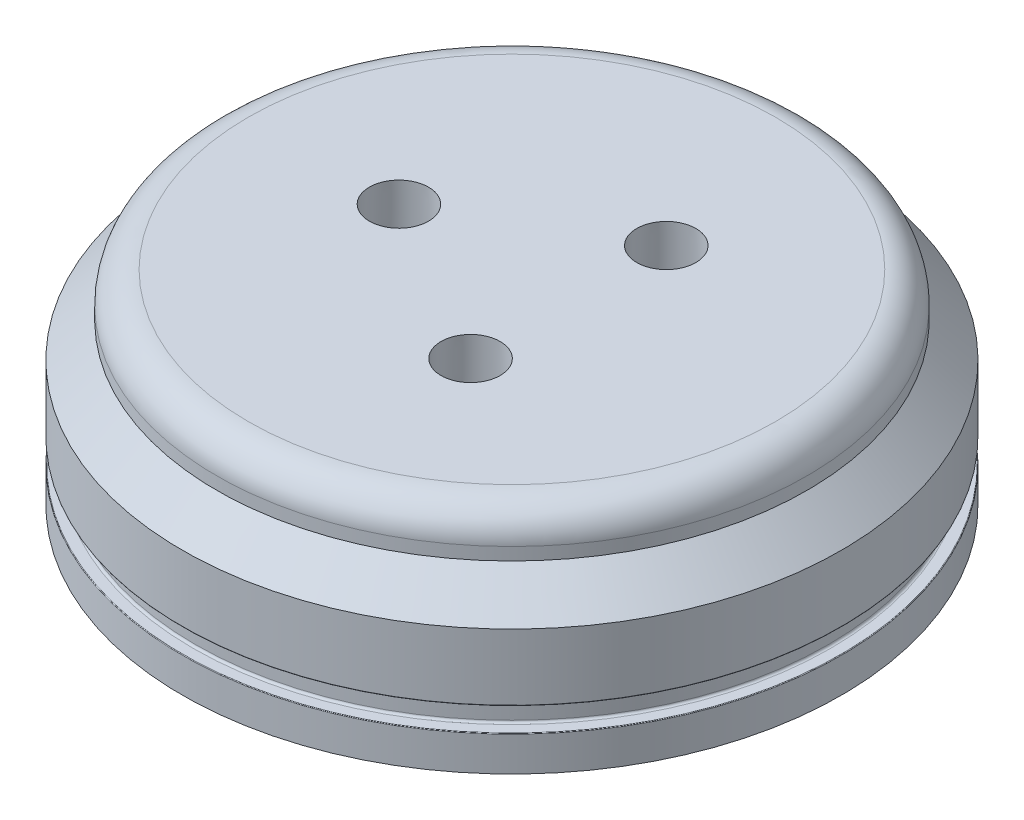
ISO-10303-21;
HEADER;
FILE_DESCRIPTION(('STEP AP214'),'2;1');
FILE_NAME('part.step','',(''),(''),'','','');
FILE_SCHEMA(('AUTOMOTIVE_DESIGN { 1 0 10303 214 1 1 1 1 }'));
ENDSEC;
DATA;
#1=APPLICATION_CONTEXT('core data for automotive mechanical design processes');
#2=APPLICATION_PROTOCOL_DEFINITION('international standard','automotive_design',2000,#1);
#3=PRODUCT_CONTEXT('',#1,'mechanical');
#4=PRODUCT('Part','Part','',(#3));
#5=PRODUCT_RELATED_PRODUCT_CATEGORY('part','',(#4));
#6=PRODUCT_DEFINITION_FORMATION('','',#4);
#7=PRODUCT_DEFINITION_CONTEXT('part definition',#1,'design');
#8=PRODUCT_DEFINITION('design','',#6,#7);
#9=PRODUCT_DEFINITION_SHAPE('','',#8);
#10=(LENGTH_UNIT() NAMED_UNIT(*) SI_UNIT(.MILLI.,.METRE.));
#11=(NAMED_UNIT(*) PLANE_ANGLE_UNIT() SI_UNIT($,.RADIAN.));
#12=(NAMED_UNIT(*) SI_UNIT($,.STERADIAN.) SOLID_ANGLE_UNIT());
#13=UNCERTAINTY_MEASURE_WITH_UNIT(LENGTH_MEASURE(1.E-05),#10,'distance_accuracy_value','');
#14=(GEOMETRIC_REPRESENTATION_CONTEXT(3) GLOBAL_UNCERTAINTY_ASSIGNED_CONTEXT((#13)) GLOBAL_UNIT_ASSIGNED_CONTEXT((#10,
#11,#12)) REPRESENTATION_CONTEXT('',''));
#15=CARTESIAN_POINT('',(0.,0.,0.));
#16=DIRECTION('',(0.,0.,1.));
#17=DIRECTION('',(1.,0.,0.));
#18=AXIS2_PLACEMENT_3D('',#15,#16,#17);
#19=CARTESIAN_POINT('',(-50.8,0.,0.));
#20=DIRECTION('',(0.,1.,0.));
#21=DIRECTION('',(0.,0.,1.));
#22=AXIS2_PLACEMENT_3D('',#19,#20,#21);
#23=PLANE('',#22);
#24=CARTESIAN_POINT('',(30.0705983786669,0.,-50.4564467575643));
#25=DIRECTION('',(0.,-1.,0.));
#26=DIRECTION('',(0.,0.,-1.));
#27=AXIS2_PLACEMENT_3D('',#24,#25,#26);
#28=CIRCLE('',#27,1.72719999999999);
#29=CARTESIAN_POINT('',(30.0705983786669,0.,-52.1836467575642));
#30=VERTEX_POINT('',#29);
#31=EDGE_CURVE('E89',#30,#30,#28,.T.);
#32=ORIENTED_EDGE('',*,*,#31,.F.);
#33=EDGE_LOOP('',(#32));
#34=FACE_BOUND('',#33,.T.);
#35=CARTESIAN_POINT('',(-38.6946065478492,0.,-44.1907380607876));
#36=DIRECTION('',(0.,-1.,0.));
#37=DIRECTION('',(0.,0.,-1.));
#38=AXIS2_PLACEMENT_3D('',#35,#36,#37);
#39=CIRCLE('',#38,1.72719999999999);
#40=CARTESIAN_POINT('',(-38.6946065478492,0.,-45.9179380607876));
#41=VERTEX_POINT('',#40);
#42=EDGE_CURVE('E106',#41,#41,#39,.T.);
#43=ORIENTED_EDGE('',*,*,#42,.F.);
#44=EDGE_LOOP('',(#43));
#45=FACE_BOUND('',#44,.T.);
#46=CARTESIAN_POINT('',(-57.6983010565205,0.,10.9999982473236));
#47=DIRECTION('',(0.,-1.,0.));
#48=DIRECTION('',(0.,0.,-1.));
#49=AXIS2_PLACEMENT_3D('',#46,#47,#48);
#50=CIRCLE('',#49,1.72719999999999);
#51=CARTESIAN_POINT('',(-57.6983010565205,0.,9.27279824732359));
#52=VERTEX_POINT('',#51);
#53=EDGE_CURVE('E112',#52,#52,#50,.T.);
#54=ORIENTED_EDGE('',*,*,#53,.F.);
#55=EDGE_LOOP('',(#54));
#56=FACE_BOUND('',#55,.T.);
#57=CARTESIAN_POINT('',(0.,0.,0.));
#58=DIRECTION('',(0.,-1.,0.));
#59=DIRECTION('',(0.,0.,-1.));
#60=AXIS2_PLACEMENT_3D('',#57,#58,#59);
#61=CIRCLE('',#60,66.675);
#62=CARTESIAN_POINT('',(0.,0.,-66.675));
#63=VERTEX_POINT('',#62);
#64=EDGE_CURVE('E175',#63,#63,#61,.T.);
#65=ORIENTED_EDGE('',*,*,#64,.T.);
#66=EDGE_LOOP('',(#65));
#67=FACE_BOUND('',#66,.T.);
#68=CARTESIAN_POINT('',(0.,0.,0.));
#69=DIRECTION('',(0.,-1.,0.));
#70=DIRECTION('',(0.,0.,-1.));
#71=AXIS2_PLACEMENT_3D('',#68,#69,#70);
#72=CIRCLE('',#71,50.8);
#73=CARTESIAN_POINT('',(0.,0.,-50.8));
#74=VERTEX_POINT('',#73);
#75=EDGE_CURVE('E178',#74,#74,#72,.T.);
#76=ORIENTED_EDGE('',*,*,#75,.F.);
#77=EDGE_LOOP('',(#76));
#78=FACE_BOUND('',#77,.T.);
#79=CARTESIAN_POINT('',(57.2792584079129,0.,13.0069390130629));
#80=DIRECTION('',(0.,-1.,0.));
#81=DIRECTION('',(0.,0.,-1.));
#82=AXIS2_PLACEMENT_3D('',#79,#80,#81);
#83=CIRCLE('',#82,1.72719999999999);
#84=CARTESIAN_POINT('',(57.2792584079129,0.,11.2797390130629));
#85=VERTEX_POINT('',#84);
#86=EDGE_CURVE('E142',#85,#85,#83,.T.);
#87=ORIENTED_EDGE('',*,*,#86,.F.);
#88=EDGE_LOOP('',(#87));
#89=FACE_BOUND('',#88,.T.);
#90=CARTESIAN_POINT('',(53.1445428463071,0.,25.0150249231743));
#91=DIRECTION('',(0.,-1.,0.));
#92=DIRECTION('',(0.,0.,-1.));
#93=AXIS2_PLACEMENT_3D('',#90,#91,#92);
#94=CIRCLE('',#93,1.72719999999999);
#95=CARTESIAN_POINT('',(53.1445428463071,0.,23.2878249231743));
#96=VERTEX_POINT('',#95);
#97=EDGE_CURVE('E136',#96,#96,#94,.T.);
#98=ORIENTED_EDGE('',*,*,#97,.F.);
#99=EDGE_LOOP('',(#98));
#100=FACE_BOUND('',#99,.T.);
#101=CARTESIAN_POINT('',(5.32993016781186,0.,58.4951771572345));
#102=DIRECTION('',(0.,-1.,0.));
#103=DIRECTION('',(0.,0.,-1.));
#104=AXIS2_PLACEMENT_3D('',#101,#102,#103);
#105=CIRCLE('',#104,1.72719999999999);
#106=CARTESIAN_POINT('',(5.32993016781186,0.,56.7679771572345));
#107=VERTEX_POINT('',#106);
#108=EDGE_CURVE('E130',#107,#107,#105,.T.);
#109=ORIENTED_EDGE('',*,*,#108,.F.);
#110=EDGE_LOOP('',(#109));
#111=FACE_BOUND('',#110,.T.);
#112=CARTESIAN_POINT('',(-7.36813556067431,0.,58.273531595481));
#113=DIRECTION('',(0.,-1.,0.));
#114=DIRECTION('',(0.,0.,-1.));
#115=AXIS2_PLACEMENT_3D('',#112,#113,#114);
#116=CIRCLE('',#115,1.72719999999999);
#117=CARTESIAN_POINT('',(-7.36813556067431,0.,56.546331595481));
#118=VERTEX_POINT('',#117);
#119=EDGE_CURVE('E124',#118,#118,#116,.T.);
#120=ORIENTED_EDGE('',*,*,#119,.F.);
#121=EDGE_LOOP('',(#120));
#122=FACE_BOUND('',#121,.T.);
#123=CARTESIAN_POINT('',(-53.9851804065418,0.,23.1450686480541));
#124=DIRECTION('',(0.,-1.,0.));
#125=DIRECTION('',(0.,0.,-1.));
#126=AXIS2_PLACEMENT_3D('',#123,#124,#125);
#127=CIRCLE('',#126,1.72719999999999);
#128=CARTESIAN_POINT('',(-53.9851804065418,0.,21.4178686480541));
#129=VERTEX_POINT('',#128);
#130=EDGE_CURVE('E118',#129,#129,#127,.T.);
#131=ORIENTED_EDGE('',*,*,#130,.F.);
#132=EDGE_LOOP('',(#131));
#133=FACE_BOUND('',#132,.T.);
#134=CARTESIAN_POINT('',(-28.291375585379,0.,-51.4751588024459));
#135=DIRECTION('',(0.,-1.,0.));
#136=DIRECTION('',(0.,0.,-1.));
#137=AXIS2_PLACEMENT_3D('',#134,#135,#136);
#138=CIRCLE('',#137,1.72719999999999);
#139=CARTESIAN_POINT('',(-28.291375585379,0.,-53.2023588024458));
#140=VERTEX_POINT('',#139);
#141=EDGE_CURVE('E100',#140,#140,#138,.T.);
#142=ORIENTED_EDGE('',*,*,#141,.F.);
#143=EDGE_LOOP('',(#142));
#144=FACE_BOUND('',#143,.T.);
#145=CARTESIAN_POINT('',(40.2132693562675,0.,-42.8133959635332));
#146=DIRECTION('',(0.,-1.,0.));
#147=DIRECTION('',(0.,0.,-1.));
#148=AXIS2_PLACEMENT_3D('',#145,#146,#147);
#149=CIRCLE('',#148,1.72719999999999);
#150=CARTESIAN_POINT('',(40.2132693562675,0.,-44.5405959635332));
#151=VERTEX_POINT('',#150);
#152=EDGE_CURVE('E90',#151,#151,#149,.T.);
#153=ORIENTED_EDGE('',*,*,#152,.F.);
#154=EDGE_LOOP('',(#153));
#155=FACE_BOUND('',#154,.T.);
#156=ADVANCED_FACE('F40',(#34,#45,#56,#67,#78,#89,#100,#111,#122,#133,#144,#155),#23,.F.);
#157=CARTESIAN_POINT('',(-59.69,41.275,0.));
#158=DIRECTION('',(0.,-1.,0.));
#159=DIRECTION('',(0.,0.,-1.));
#160=AXIS2_PLACEMENT_3D('',#157,#158,#159);
#161=PLANE('',#160);
#162=CARTESIAN_POINT('',(0.,41.275,0.));
#163=DIRECTION('',(0.,-1.,0.));
#164=DIRECTION('',(0.,0.,-1.));
#165=AXIS2_PLACEMENT_3D('',#162,#163,#164);
#166=CIRCLE('',#165,53.34);
#167=CARTESIAN_POINT('',(0.,41.275,-53.34));
#168=VERTEX_POINT('',#167);
#169=EDGE_CURVE('E205',#168,#168,#166,.F.);
#170=ORIENTED_EDGE('',*,*,#169,.T.);
#171=EDGE_LOOP('',(#170));
#172=FACE_BOUND('',#171,.T.);
#173=CARTESIAN_POINT('',(11.4299999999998,41.275,19.7973407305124));
#174=DIRECTION('',(0.,-1.,0.));
#175=DIRECTION('',(0.,0.,-1.));
#176=AXIS2_PLACEMENT_3D('',#173,#174,#175);
#177=CIRCLE('',#176,5.97790349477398);
#178=CARTESIAN_POINT('',(11.4299999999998,41.275,13.8194372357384));
#179=VERTEX_POINT('',#178);
#180=EDGE_CURVE('E151',#179,#179,#177,.T.);
#181=ORIENTED_EDGE('',*,*,#180,.T.);
#182=EDGE_LOOP('',(#181));
#183=FACE_BOUND('',#182,.T.);
#184=CARTESIAN_POINT('',(-22.86,41.275,0.));
#185=DIRECTION('',(0.,-1.,0.));
#186=DIRECTION('',(0.,0.,-1.));
#187=AXIS2_PLACEMENT_3D('',#184,#185,#186);
#188=CIRCLE('',#187,5.97790349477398);
#189=CARTESIAN_POINT('',(-22.86,41.275,-5.97790349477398));
#190=VERTEX_POINT('',#189);
#191=EDGE_CURVE('E163',#190,#190,#188,.T.);
#192=ORIENTED_EDGE('',*,*,#191,.T.);
#193=EDGE_LOOP('',(#192));
#194=FACE_BOUND('',#193,.T.);
#195=CARTESIAN_POINT('',(11.4300000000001,41.275,-19.7973407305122));
#196=DIRECTION('',(0.,-1.,0.));
#197=DIRECTION('',(0.,0.,-1.));
#198=AXIS2_PLACEMENT_3D('',#195,#196,#197);
#199=CIRCLE('',#198,5.97790349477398);
#200=CARTESIAN_POINT('',(11.4300000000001,41.275,-25.7752442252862));
#201=VERTEX_POINT('',#200);
#202=EDGE_CURVE('E157',#201,#201,#199,.T.);
#203=ORIENTED_EDGE('',*,*,#202,.T.);
#204=EDGE_LOOP('',(#203));
#205=FACE_BOUND('',#204,.T.);
#206=ADVANCED_FACE('F227',(#172,#183,#194,#205),#161,.F.);
#207=CARTESIAN_POINT('',(0.,7.5565,0.));
#208=DIRECTION('',(0.,-1.,0.));
#209=DIRECTION('',(0.,0.,-1.));
#210=AXIS2_PLACEMENT_3D('',#207,#208,#209);
#211=TOROIDAL_SURFACE('',#210,64.4779,0.444500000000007);
#212=CARTESIAN_POINT('',(0.,7.112,0.));
#213=DIRECTION('',(0.,-1.,0.));
#214=DIRECTION('',(0.,0.,-1.));
#215=AXIS2_PLACEMENT_3D('',#212,#213,#214);
#216=CIRCLE('',#215,64.4779);
#217=CARTESIAN_POINT('',(0.,7.112,-64.4779));
#218=VERTEX_POINT('',#217);
#219=EDGE_CURVE('E166',#218,#218,#216,.T.);
#220=ORIENTED_EDGE('',*,*,#219,.F.);
#221=EDGE_LOOP('',(#220));
#222=FACE_BOUND('',#221,.T.);
#223=CARTESIAN_POINT('',(0.,7.5565,0.));
#224=DIRECTION('',(0.,-1.,0.));
#225=DIRECTION('',(0.,0.,-1.));
#226=AXIS2_PLACEMENT_3D('',#223,#224,#225);
#227=CIRCLE('',#226,64.0334);
#228=CARTESIAN_POINT('',(0.,7.5565,-64.0334));
#229=VERTEX_POINT('',#228);
#230=EDGE_CURVE('E199',#229,#229,#227,.T.);
#231=ORIENTED_EDGE('',*,*,#230,.T.);
#232=EDGE_LOOP('',(#231));
#233=FACE_BOUND('',#232,.T.);
#234=ADVANCED_FACE('F233',(#222,#233),#211,.F.);
#235=CARTESIAN_POINT('',(0.,0.,0.));
#236=DIRECTION('',(0.,-1.,0.));
#237=DIRECTION('',(0.,0.,-1.));
#238=AXIS2_PLACEMENT_3D('',#235,#236,#237);
#239=CYLINDRICAL_SURFACE('',#238,64.0334);
#240=ORIENTED_EDGE('',*,*,#230,.F.);
#241=EDGE_LOOP('',(#240));
#242=FACE_BOUND('',#241,.T.);
#243=CARTESIAN_POINT('',(0.,11.4935,0.));
#244=DIRECTION('',(0.,-1.,0.));
#245=DIRECTION('',(0.,0.,-1.));
#246=AXIS2_PLACEMENT_3D('',#243,#244,#245);
#247=CIRCLE('',#246,64.0334);
#248=CARTESIAN_POINT('',(0.,11.4935,-64.0334));
#249=VERTEX_POINT('',#248);
#250=EDGE_CURVE('E196',#249,#249,#247,.T.);
#251=ORIENTED_EDGE('',*,*,#250,.T.);
#252=EDGE_LOOP('',(#251));
#253=FACE_BOUND('',#252,.T.);
#254=ADVANCED_FACE('F271',(#242,#253),#239,.T.);
#255=CARTESIAN_POINT('',(0.,11.4935,0.));
#256=DIRECTION('',(0.,-1.,0.));
#257=DIRECTION('',(0.,0.,-1.));
#258=AXIS2_PLACEMENT_3D('',#255,#256,#257);
#259=TOROIDAL_SURFACE('',#258,64.4779,0.444500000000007);
#260=ORIENTED_EDGE('',*,*,#250,.F.);
#261=EDGE_LOOP('',(#260));
#262=FACE_BOUND('',#261,.T.);
#263=CARTESIAN_POINT('',(0.,11.938,0.));
#264=DIRECTION('',(0.,-1.,0.));
#265=DIRECTION('',(0.,0.,-1.));
#266=AXIS2_PLACEMENT_3D('',#263,#264,#265);
#267=CIRCLE('',#266,64.4779);
#268=CARTESIAN_POINT('',(0.,11.938,-64.4779));
#269=VERTEX_POINT('',#268);
#270=EDGE_CURVE('E193',#269,#269,#267,.T.);
#271=ORIENTED_EDGE('',*,*,#270,.T.);
#272=EDGE_LOOP('',(#271));
#273=FACE_BOUND('',#272,.T.);
#274=ADVANCED_FACE('F267',(#262,#273),#259,.F.);
#275=CARTESIAN_POINT('',(-66.548,11.938,0.));
#276=DIRECTION('',(0.,1.,0.));
#277=DIRECTION('',(0.,0.,1.));
#278=AXIS2_PLACEMENT_3D('',#275,#276,#277);
#279=PLANE('',#278);
#280=ORIENTED_EDGE('',*,*,#270,.F.);
#281=EDGE_LOOP('',(#280));
#282=FACE_BOUND('',#281,.T.);
#283=CARTESIAN_POINT('',(0.,11.938,0.));
#284=DIRECTION('',(0.,-1.,0.));
#285=DIRECTION('',(0.,0.,-1.));
#286=AXIS2_PLACEMENT_3D('',#283,#284,#285);
#287=CIRCLE('',#286,66.548);
#288=CARTESIAN_POINT('',(0.,11.938,-66.548));
#289=VERTEX_POINT('',#288);
#290=EDGE_CURVE('E190',#289,#289,#287,.T.);
#291=ORIENTED_EDGE('',*,*,#290,.T.);
#292=EDGE_LOOP('',(#291));
#293=FACE_BOUND('',#292,.T.);
#294=ADVANCED_FACE('F263',(#282,#293),#279,.F.);
#295=CARTESIAN_POINT('',(0.,12.065,0.));
#296=DIRECTION('',(0.,-1.,0.));
#297=DIRECTION('',(0.,0.,-1.));
#298=AXIS2_PLACEMENT_3D('',#295,#296,#297);
#299=TOROIDAL_SURFACE('',#298,66.548,0.127000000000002);
#300=ORIENTED_EDGE('',*,*,#290,.F.);
#301=EDGE_LOOP('',(#300));
#302=FACE_BOUND('',#301,.T.);
#303=CARTESIAN_POINT('',(0.,12.065,0.));
#304=DIRECTION('',(0.,-1.,0.));
#305=DIRECTION('',(0.,0.,-1.));
#306=AXIS2_PLACEMENT_3D('',#303,#304,#305);
#307=CIRCLE('',#306,66.675);
#308=CARTESIAN_POINT('',(0.,12.065,-66.675));
#309=VERTEX_POINT('',#308);
#310=EDGE_CURVE('E187',#309,#309,#307,.T.);
#311=ORIENTED_EDGE('',*,*,#310,.T.);
#312=EDGE_LOOP('',(#311));
#313=FACE_BOUND('',#312,.T.);
#314=ADVANCED_FACE('F259',(#302,#313),#299,.T.);
#315=CARTESIAN_POINT('',(0.,0.,0.));
#316=DIRECTION('',(0.,-1.,0.));
#317=DIRECTION('',(0.,0.,-1.));
#318=AXIS2_PLACEMENT_3D('',#315,#316,#317);
#319=CYLINDRICAL_SURFACE('',#318,66.675);
#320=ORIENTED_EDGE('',*,*,#310,.F.);
#321=EDGE_LOOP('',(#320));
#322=FACE_BOUND('',#321,.T.);
#323=CARTESIAN_POINT('',(0.,25.4,0.));
#324=DIRECTION('',(0.,-1.,0.));
#325=DIRECTION('',(0.,0.,-1.));
#326=AXIS2_PLACEMENT_3D('',#323,#324,#325);
#327=CIRCLE('',#326,66.675);
#328=CARTESIAN_POINT('',(0.,25.4,-66.675));
#329=VERTEX_POINT('',#328);
#330=EDGE_CURVE('E184',#329,#329,#327,.T.);
#331=ORIENTED_EDGE('',*,*,#330,.T.);
#332=EDGE_LOOP('',(#331));
#333=FACE_BOUND('',#332,.T.);
#334=ADVANCED_FACE('F255',(#322,#333),#319,.T.);
#335=CARTESIAN_POINT('',(0.,32.385,0.));
#336=DIRECTION('',(0.,-1.,0.));
#337=DIRECTION('',(0.,0.,-1.));
#338=AXIS2_PLACEMENT_3D('',#335,#336,#337);
#339=CONICAL_SURFACE('',#338,59.69,0.78539816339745);
#340=ORIENTED_EDGE('',*,*,#330,.F.);
#341=EDGE_LOOP('',(#340));
#342=FACE_BOUND('',#341,.T.);
#343=CARTESIAN_POINT('',(0.,32.385,0.));
#344=DIRECTION('',(0.,-1.,0.));
#345=DIRECTION('',(0.,0.,-1.));
#346=AXIS2_PLACEMENT_3D('',#343,#344,#345);
#347=CIRCLE('',#346,59.69);
#348=CARTESIAN_POINT('',(0.,32.385,-59.69));
#349=VERTEX_POINT('',#348);
#350=EDGE_CURVE('E181',#349,#349,#347,.T.);
#351=ORIENTED_EDGE('',*,*,#350,.T.);
#352=EDGE_LOOP('',(#351));
#353=FACE_BOUND('',#352,.T.);
#354=ADVANCED_FACE('F251',(#342,#353),#339,.T.);
#355=CARTESIAN_POINT('',(0.,0.,0.));
#356=DIRECTION('',(0.,-1.,0.));
#357=DIRECTION('',(0.,0.,-1.));
#358=AXIS2_PLACEMENT_3D('',#355,#356,#357);
#359=CYLINDRICAL_SURFACE('',#358,59.69);
#360=CARTESIAN_POINT('',(0.,34.925,0.));
#361=DIRECTION('',(0.,-1.,0.));
#362=DIRECTION('',(0.,0.,-1.));
#363=AXIS2_PLACEMENT_3D('',#360,#361,#362);
#364=CIRCLE('',#363,59.69);
#365=CARTESIAN_POINT('',(0.,34.925,-59.69));
#366=VERTEX_POINT('',#365);
#367=EDGE_CURVE('E202',#366,#366,#364,.T.);
#368=ORIENTED_EDGE('',*,*,#367,.T.);
#369=EDGE_LOOP('',(#368));
#370=FACE_BOUND('',#369,.T.);
#371=ORIENTED_EDGE('',*,*,#350,.F.);
#372=EDGE_LOOP('',(#371));
#373=FACE_BOUND('',#372,.T.);
#374=ADVANCED_FACE('F247',(#370,#373),#359,.T.);
#375=CARTESIAN_POINT('',(-50.8,32.385,0.));
#376=DIRECTION('',(0.,1.,0.));
#377=DIRECTION('',(0.,0.,1.));
#378=AXIS2_PLACEMENT_3D('',#375,#376,#377);
#379=PLANE('',#378);
#380=CARTESIAN_POINT('',(0.,32.385,0.));
#381=DIRECTION('',(0.,1.,0.));
#382=DIRECTION('',(0.,0.,1.));
#383=AXIS2_PLACEMENT_3D('',#380,#381,#382);
#384=CIRCLE('',#383,44.45);
#385=CARTESIAN_POINT('',(0.,32.385,44.45));
#386=VERTEX_POINT('',#385);
#387=EDGE_CURVE('E48',#386,#386,#384,.F.);
#388=ORIENTED_EDGE('',*,*,#387,.T.);
#389=EDGE_LOOP('',(#388));
#390=FACE_BOUND('',#389,.T.);
#391=CARTESIAN_POINT('',(11.4299999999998,32.385,19.7973407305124));
#392=DIRECTION('',(0.,-1.,0.));
#393=DIRECTION('',(0.,0.,-1.));
#394=AXIS2_PLACEMENT_3D('',#391,#392,#393);
#395=CIRCLE('',#394,6.244082);
#396=CARTESIAN_POINT('',(11.4299999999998,32.385,13.5532587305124));
#397=VERTEX_POINT('',#396);
#398=EDGE_CURVE('E148',#397,#397,#395,.T.);
#399=ORIENTED_EDGE('',*,*,#398,.F.);
#400=EDGE_LOOP('',(#399));
#401=FACE_BOUND('',#400,.T.);
#402=CARTESIAN_POINT('',(11.4300000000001,32.385,-19.7973407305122));
#403=DIRECTION('',(0.,-1.,0.));
#404=DIRECTION('',(0.,0.,-1.));
#405=AXIS2_PLACEMENT_3D('',#402,#403,#404);
#406=CIRCLE('',#405,6.244082);
#407=CARTESIAN_POINT('',(11.4300000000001,32.385,-26.0414227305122));
#408=VERTEX_POINT('',#407);
#409=EDGE_CURVE('E154',#408,#408,#406,.T.);
#410=ORIENTED_EDGE('',*,*,#409,.F.);
#411=EDGE_LOOP('',(#410));
#412=FACE_BOUND('',#411,.T.);
#413=CARTESIAN_POINT('',(-22.86,32.385,0.));
#414=DIRECTION('',(0.,-1.,0.));
#415=DIRECTION('',(0.,0.,-1.));
#416=AXIS2_PLACEMENT_3D('',#413,#414,#415);
#417=CIRCLE('',#416,6.244082);
#418=CARTESIAN_POINT('',(-22.86,32.385,-6.244082));
#419=VERTEX_POINT('',#418);
#420=EDGE_CURVE('E160',#419,#419,#417,.T.);
#421=ORIENTED_EDGE('',*,*,#420,.F.);
#422=EDGE_LOOP('',(#421));
#423=FACE_BOUND('',#422,.T.);
#424=ADVANCED_FACE('F210',(#390,#401,#412,#423),#379,.F.);
#425=CARTESIAN_POINT('',(0.,0.,0.));
#426=DIRECTION('',(0.,-1.,0.));
#427=DIRECTION('',(0.,0.,-1.));
#428=AXIS2_PLACEMENT_3D('',#425,#426,#427);
#429=CYLINDRICAL_SURFACE('',#428,50.8);
#430=CARTESIAN_POINT('',(0.,26.035,0.));
#431=DIRECTION('',(0.,1.,0.));
#432=DIRECTION('',(0.,0.,1.));
#433=AXIS2_PLACEMENT_3D('',#430,#431,#432);
#434=CIRCLE('',#433,50.8);
#435=CARTESIAN_POINT('',(0.,26.035,50.8));
#436=VERTEX_POINT('',#435);
#437=EDGE_CURVE('E11',#436,#436,#434,.T.);
#438=ORIENTED_EDGE('',*,*,#437,.T.);
#439=EDGE_LOOP('',(#438));
#440=FACE_BOUND('',#439,.T.);
#441=ORIENTED_EDGE('',*,*,#75,.T.);
#442=EDGE_LOOP('',(#441));
#443=FACE_BOUND('',#442,.T.);
#444=ADVANCED_FACE('F242',(#440,#443),#429,.F.);
#445=CARTESIAN_POINT('',(0.,0.,0.));
#446=DIRECTION('',(0.,-1.,0.));
#447=DIRECTION('',(0.,0.,-1.));
#448=AXIS2_PLACEMENT_3D('',#445,#446,#447);
#449=CYLINDRICAL_SURFACE('',#448,66.675);
#450=ORIENTED_EDGE('',*,*,#64,.F.);
#451=EDGE_LOOP('',(#450));
#452=FACE_BOUND('',#451,.T.);
#453=CARTESIAN_POINT('',(0.,6.985,0.));
#454=DIRECTION('',(0.,-1.,0.));
#455=DIRECTION('',(0.,0.,-1.));
#456=AXIS2_PLACEMENT_3D('',#453,#454,#455);
#457=CIRCLE('',#456,66.675);
#458=CARTESIAN_POINT('',(0.,6.985,-66.675));
#459=VERTEX_POINT('',#458);
#460=EDGE_CURVE('E172',#459,#459,#457,.T.);
#461=ORIENTED_EDGE('',*,*,#460,.T.);
#462=EDGE_LOOP('',(#461));
#463=FACE_BOUND('',#462,.T.);
#464=ADVANCED_FACE('F240',(#452,#463),#449,.T.);
#465=CARTESIAN_POINT('',(0.,6.985,0.));
#466=DIRECTION('',(0.,-1.,0.));
#467=DIRECTION('',(0.,0.,-1.));
#468=AXIS2_PLACEMENT_3D('',#465,#466,#467);
#469=TOROIDAL_SURFACE('',#468,66.548,0.127000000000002);
#470=ORIENTED_EDGE('',*,*,#460,.F.);
#471=EDGE_LOOP('',(#470));
#472=FACE_BOUND('',#471,.T.);
#473=CARTESIAN_POINT('',(0.,7.112,0.));
#474=DIRECTION('',(0.,-1.,0.));
#475=DIRECTION('',(0.,0.,-1.));
#476=AXIS2_PLACEMENT_3D('',#473,#474,#475);
#477=CIRCLE('',#476,66.548);
#478=CARTESIAN_POINT('',(0.,7.112,-66.548));
#479=VERTEX_POINT('',#478);
#480=EDGE_CURVE('E169',#479,#479,#477,.T.);
#481=ORIENTED_EDGE('',*,*,#480,.T.);
#482=EDGE_LOOP('',(#481));
#483=FACE_BOUND('',#482,.T.);
#484=ADVANCED_FACE('F300',(#472,#483),#469,.T.);
#485=CARTESIAN_POINT('',(-64.4779,7.112,0.));
#486=DIRECTION('',(0.,-1.,0.));
#487=DIRECTION('',(0.,0.,-1.));
#488=AXIS2_PLACEMENT_3D('',#485,#486,#487);
#489=PLANE('',#488);
#490=ORIENTED_EDGE('',*,*,#480,.F.);
#491=EDGE_LOOP('',(#490));
#492=FACE_BOUND('',#491,.T.);
#493=ORIENTED_EDGE('',*,*,#219,.T.);
#494=EDGE_LOOP('',(#493));
#495=FACE_BOUND('',#494,.T.);
#496=ADVANCED_FACE('F297',(#492,#495),#489,.F.);
#497=CARTESIAN_POINT('',(-22.86,32.385,0.));
#498=DIRECTION('',(0.,-1.,0.));
#499=DIRECTION('',(0.,0.,-1.));
#500=AXIS2_PLACEMENT_3D('',#497,#498,#499);
#501=CONICAL_SURFACE('',#500,6.244082,0.0299323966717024);
#502=ORIENTED_EDGE('',*,*,#420,.T.);
#503=EDGE_LOOP('',(#502));
#504=FACE_BOUND('',#503,.T.);
#505=ORIENTED_EDGE('',*,*,#191,.F.);
#506=EDGE_LOOP('',(#505));
#507=FACE_BOUND('',#506,.T.);
#508=ADVANCED_FACE('F299',(#504,#507),#501,.F.);
#509=CARTESIAN_POINT('',(11.4300000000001,32.385,-19.7973407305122));
#510=DIRECTION('',(0.,-1.,0.));
#511=DIRECTION('',(0.,0.,-1.));
#512=AXIS2_PLACEMENT_3D('',#509,#510,#511);
#513=CONICAL_SURFACE('',#512,6.244082,0.0299323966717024);
#514=ORIENTED_EDGE('',*,*,#409,.T.);
#515=EDGE_LOOP('',(#514));
#516=FACE_BOUND('',#515,.T.);
#517=ORIENTED_EDGE('',*,*,#202,.F.);
#518=EDGE_LOOP('',(#517));
#519=FACE_BOUND('',#518,.T.);
#520=ADVANCED_FACE('F307',(#516,#519),#513,.F.);
#521=CARTESIAN_POINT('',(11.4299999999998,32.385,19.7973407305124));
#522=DIRECTION('',(0.,-1.,0.));
#523=DIRECTION('',(0.,0.,-1.));
#524=AXIS2_PLACEMENT_3D('',#521,#522,#523);
#525=CONICAL_SURFACE('',#524,6.244082,0.0299323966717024);
#526=ORIENTED_EDGE('',*,*,#398,.T.);
#527=EDGE_LOOP('',(#526));
#528=FACE_BOUND('',#527,.T.);
#529=ORIENTED_EDGE('',*,*,#180,.F.);
#530=EDGE_LOOP('',(#529));
#531=FACE_BOUND('',#530,.T.);
#532=ADVANCED_FACE('F223',(#528,#531),#525,.F.);
#533=CARTESIAN_POINT('',(0.,34.925,0.));
#534=DIRECTION('',(0.,-1.,0.));
#535=DIRECTION('',(0.,0.,-1.));
#536=AXIS2_PLACEMENT_3D('',#533,#534,#535);
#537=TOROIDAL_SURFACE('',#536,53.34,6.35);
#538=ORIENTED_EDGE('',*,*,#169,.F.);
#539=EDGE_LOOP('',(#538));
#540=FACE_BOUND('',#539,.T.);
#541=ORIENTED_EDGE('',*,*,#367,.F.);
#542=EDGE_LOOP('',(#541));
#543=FACE_BOUND('',#542,.T.);
#544=ADVANCED_FACE('F215',(#540,#543),#537,.T.);
#545=CARTESIAN_POINT('',(0.,26.035,0.));
#546=DIRECTION('',(0.,1.,0.));
#547=DIRECTION('',(0.,0.,1.));
#548=AXIS2_PLACEMENT_3D('',#545,#546,#547);
#549=TOROIDAL_SURFACE('',#548,44.45,6.35);
#550=ORIENTED_EDGE('',*,*,#437,.F.);
#551=EDGE_LOOP('',(#550));
#552=FACE_BOUND('',#551,.T.);
#553=ORIENTED_EDGE('',*,*,#387,.F.);
#554=EDGE_LOOP('',(#553));
#555=FACE_BOUND('',#554,.T.);
#556=ADVANCED_FACE('F42',(#552,#555),#549,.F.);
#557=CARTESIAN_POINT('',(57.2792584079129,12.2936,13.0069390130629));
#558=DIRECTION('',(0.,-1.,0.));
#559=DIRECTION('',(0.,0.,-1.));
#560=AXIS2_PLACEMENT_3D('',#557,#558,#559);
#561=CONICAL_SURFACE('',#560,1.72719999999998,1.02974425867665);
#562=CARTESIAN_POINT('',(57.2792584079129,13.3314064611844,13.0069390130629));
#563=VERTEX_POINT('',#562);
#564=VERTEX_LOOP('',#563);
#565=FACE_BOUND('',#564,.T.);
#566=CARTESIAN_POINT('',(57.2792584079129,12.2936,13.0069390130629));
#567=DIRECTION('',(0.,-1.,0.));
#568=DIRECTION('',(0.,0.,-1.));
#569=AXIS2_PLACEMENT_3D('',#566,#567,#568);
#570=CIRCLE('',#569,1.72719999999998);
#571=CARTESIAN_POINT('',(57.2792584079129,12.2936,11.2797390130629));
#572=VERTEX_POINT('',#571);
#573=EDGE_CURVE('E145',#572,#572,#570,.T.);
#574=ORIENTED_EDGE('',*,*,#573,.T.);
#575=EDGE_LOOP('',(#574));
#576=FACE_BOUND('',#575,.T.);
#577=ADVANCED_FACE('F214',(#565,#576),#561,.F.);
#578=CARTESIAN_POINT('',(57.2792584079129,0.,13.0069390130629));
#579=DIRECTION('',(0.,-1.,0.));
#580=DIRECTION('',(0.,0.,-1.));
#581=AXIS2_PLACEMENT_3D('',#578,#579,#580);
#582=CYLINDRICAL_SURFACE('',#581,1.72719999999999);
#583=ORIENTED_EDGE('',*,*,#573,.F.);
#584=EDGE_LOOP('',(#583));
#585=FACE_BOUND('',#584,.T.);
#586=ORIENTED_EDGE('',*,*,#86,.T.);
#587=EDGE_LOOP('',(#586));
#588=FACE_BOUND('',#587,.T.);
#589=ADVANCED_FACE('F221',(#585,#588),#582,.F.);
#590=CARTESIAN_POINT('',(53.1445428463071,12.2936,25.0150249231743));
#591=DIRECTION('',(0.,-1.,0.));
#592=DIRECTION('',(0.,0.,-1.));
#593=AXIS2_PLACEMENT_3D('',#590,#591,#592);
#594=CONICAL_SURFACE('',#593,1.72719999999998,1.02974425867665);
#595=CARTESIAN_POINT('',(53.1445428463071,13.3314064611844,25.0150249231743));
#596=VERTEX_POINT('',#595);
#597=VERTEX_LOOP('',#596);
#598=FACE_BOUND('',#597,.T.);
#599=CARTESIAN_POINT('',(53.1445428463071,12.2936,25.0150249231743));
#600=DIRECTION('',(0.,-1.,0.));
#601=DIRECTION('',(0.,0.,-1.));
#602=AXIS2_PLACEMENT_3D('',#599,#600,#601);
#603=CIRCLE('',#602,1.72719999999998);
#604=CARTESIAN_POINT('',(53.1445428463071,12.2936,23.2878249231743));
#605=VERTEX_POINT('',#604);
#606=EDGE_CURVE('E139',#605,#605,#603,.T.);
#607=ORIENTED_EDGE('',*,*,#606,.T.);
#608=EDGE_LOOP('',(#607));
#609=FACE_BOUND('',#608,.T.);
#610=ADVANCED_FACE('F321',(#598,#609),#594,.F.);
#611=CARTESIAN_POINT('',(53.1445428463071,0.,25.0150249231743));
#612=DIRECTION('',(0.,-1.,0.));
#613=DIRECTION('',(0.,0.,-1.));
#614=AXIS2_PLACEMENT_3D('',#611,#612,#613);
#615=CYLINDRICAL_SURFACE('',#614,1.72719999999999);
#616=ORIENTED_EDGE('',*,*,#606,.F.);
#617=EDGE_LOOP('',(#616));
#618=FACE_BOUND('',#617,.T.);
#619=ORIENTED_EDGE('',*,*,#97,.T.);
#620=EDGE_LOOP('',(#619));
#621=FACE_BOUND('',#620,.T.);
#622=ADVANCED_FACE('F325',(#618,#621),#615,.F.);
#623=CARTESIAN_POINT('',(5.32993016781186,12.2936,58.4951771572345));
#624=DIRECTION('',(0.,-1.,0.));
#625=DIRECTION('',(0.,0.,-1.));
#626=AXIS2_PLACEMENT_3D('',#623,#624,#625);
#627=CONICAL_SURFACE('',#626,1.72719999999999,1.02974425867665);
#628=CARTESIAN_POINT('',(5.32993016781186,13.3314064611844,58.4951771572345));
#629=VERTEX_POINT('',#628);
#630=VERTEX_LOOP('',#629);
#631=FACE_BOUND('',#630,.T.);
#632=CARTESIAN_POINT('',(5.32993016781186,12.2936,58.4951771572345));
#633=DIRECTION('',(0.,-1.,0.));
#634=DIRECTION('',(0.,0.,-1.));
#635=AXIS2_PLACEMENT_3D('',#632,#633,#634);
#636=CIRCLE('',#635,1.72719999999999);
#637=CARTESIAN_POINT('',(5.32993016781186,12.2936,56.7679771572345));
#638=VERTEX_POINT('',#637);
#639=EDGE_CURVE('E133',#638,#638,#636,.T.);
#640=ORIENTED_EDGE('',*,*,#639,.T.);
#641=EDGE_LOOP('',(#640));
#642=FACE_BOUND('',#641,.T.);
#643=ADVANCED_FACE('F328',(#631,#642),#627,.F.);
#644=CARTESIAN_POINT('',(5.32993016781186,0.,58.4951771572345));
#645=DIRECTION('',(0.,-1.,0.));
#646=DIRECTION('',(0.,0.,-1.));
#647=AXIS2_PLACEMENT_3D('',#644,#645,#646);
#648=CYLINDRICAL_SURFACE('',#647,1.72719999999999);
#649=ORIENTED_EDGE('',*,*,#639,.F.);
#650=EDGE_LOOP('',(#649));
#651=FACE_BOUND('',#650,.T.);
#652=ORIENTED_EDGE('',*,*,#108,.T.);
#653=EDGE_LOOP('',(#652));
#654=FACE_BOUND('',#653,.T.);
#655=ADVANCED_FACE('F332',(#651,#654),#648,.F.);
#656=CARTESIAN_POINT('',(-7.36813556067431,12.2936,58.273531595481));
#657=DIRECTION('',(0.,-1.,0.));
#658=DIRECTION('',(0.,0.,-1.));
#659=AXIS2_PLACEMENT_3D('',#656,#657,#658);
#660=CONICAL_SURFACE('',#659,1.72719999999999,1.02974425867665);
#661=CARTESIAN_POINT('',(-7.36813556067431,13.3314064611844,58.273531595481));
#662=VERTEX_POINT('',#661);
#663=VERTEX_LOOP('',#662);
#664=FACE_BOUND('',#663,.T.);
#665=CARTESIAN_POINT('',(-7.36813556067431,12.2936,58.273531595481));
#666=DIRECTION('',(0.,-1.,0.));
#667=DIRECTION('',(0.,0.,-1.));
#668=AXIS2_PLACEMENT_3D('',#665,#666,#667);
#669=CIRCLE('',#668,1.72719999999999);
#670=CARTESIAN_POINT('',(-7.36813556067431,12.2936,56.5463315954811));
#671=VERTEX_POINT('',#670);
#672=EDGE_CURVE('E127',#671,#671,#669,.T.);
#673=ORIENTED_EDGE('',*,*,#672,.T.);
#674=EDGE_LOOP('',(#673));
#675=FACE_BOUND('',#674,.T.);
#676=ADVANCED_FACE('F336',(#664,#675),#660,.F.);
#677=CARTESIAN_POINT('',(-7.36813556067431,0.,58.273531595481));
#678=DIRECTION('',(0.,-1.,0.));
#679=DIRECTION('',(0.,0.,-1.));
#680=AXIS2_PLACEMENT_3D('',#677,#678,#679);
#681=CYLINDRICAL_SURFACE('',#680,1.72719999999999);
#682=ORIENTED_EDGE('',*,*,#672,.F.);
#683=EDGE_LOOP('',(#682));
#684=FACE_BOUND('',#683,.T.);
#685=ORIENTED_EDGE('',*,*,#119,.T.);
#686=EDGE_LOOP('',(#685));
#687=FACE_BOUND('',#686,.T.);
#688=ADVANCED_FACE('F340',(#684,#687),#681,.F.);
#689=CARTESIAN_POINT('',(-53.9851804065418,12.2936,23.1450686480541));
#690=DIRECTION('',(0.,-1.,0.));
#691=DIRECTION('',(0.,0.,-1.));
#692=AXIS2_PLACEMENT_3D('',#689,#690,#691);
#693=CONICAL_SURFACE('',#692,1.72719999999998,1.02974425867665);
#694=CARTESIAN_POINT('',(-53.9851804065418,13.3314064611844,23.1450686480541));
#695=VERTEX_POINT('',#694);
#696=VERTEX_LOOP('',#695);
#697=FACE_BOUND('',#696,.T.);
#698=CARTESIAN_POINT('',(-53.9851804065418,12.2936,23.1450686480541));
#699=DIRECTION('',(0.,-1.,0.));
#700=DIRECTION('',(0.,0.,-1.));
#701=AXIS2_PLACEMENT_3D('',#698,#699,#700);
#702=CIRCLE('',#701,1.72719999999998);
#703=CARTESIAN_POINT('',(-53.9851804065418,12.2936,21.4178686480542));
#704=VERTEX_POINT('',#703);
#705=EDGE_CURVE('E121',#704,#704,#702,.T.);
#706=ORIENTED_EDGE('',*,*,#705,.T.);
#707=EDGE_LOOP('',(#706));
#708=FACE_BOUND('',#707,.T.);
#709=ADVANCED_FACE('F344',(#697,#708),#693,.F.);
#710=CARTESIAN_POINT('',(-53.9851804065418,0.,23.1450686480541));
#711=DIRECTION('',(0.,-1.,0.));
#712=DIRECTION('',(0.,0.,-1.));
#713=AXIS2_PLACEMENT_3D('',#710,#711,#712);
#714=CYLINDRICAL_SURFACE('',#713,1.72719999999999);
#715=ORIENTED_EDGE('',*,*,#705,.F.);
#716=EDGE_LOOP('',(#715));
#717=FACE_BOUND('',#716,.T.);
#718=ORIENTED_EDGE('',*,*,#130,.T.);
#719=EDGE_LOOP('',(#718));
#720=FACE_BOUND('',#719,.T.);
#721=ADVANCED_FACE('F348',(#717,#720),#714,.F.);
#722=CARTESIAN_POINT('',(-57.6983010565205,12.2936,10.9999982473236));
#723=DIRECTION('',(0.,-1.,0.));
#724=DIRECTION('',(0.,0.,-1.));
#725=AXIS2_PLACEMENT_3D('',#722,#723,#724);
#726=CONICAL_SURFACE('',#725,1.72719999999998,1.02974425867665);
#727=CARTESIAN_POINT('',(-57.6983010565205,13.3314064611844,10.9999982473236));
#728=VERTEX_POINT('',#727);
#729=VERTEX_LOOP('',#728);
#730=FACE_BOUND('',#729,.T.);
#731=CARTESIAN_POINT('',(-57.6983010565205,12.2936,10.9999982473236));
#732=DIRECTION('',(0.,-1.,0.));
#733=DIRECTION('',(0.,0.,-1.));
#734=AXIS2_PLACEMENT_3D('',#731,#732,#733);
#735=CIRCLE('',#734,1.72719999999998);
#736=CARTESIAN_POINT('',(-57.6983010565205,12.2936,9.27279824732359));
#737=VERTEX_POINT('',#736);
#738=EDGE_CURVE('E115',#737,#737,#735,.T.);
#739=ORIENTED_EDGE('',*,*,#738,.T.);
#740=EDGE_LOOP('',(#739));
#741=FACE_BOUND('',#740,.T.);
#742=ADVANCED_FACE('F352',(#730,#741),#726,.F.);
#743=CARTESIAN_POINT('',(-57.6983010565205,0.,10.9999982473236));
#744=DIRECTION('',(0.,-1.,0.));
#745=DIRECTION('',(0.,0.,-1.));
#746=AXIS2_PLACEMENT_3D('',#743,#744,#745);
#747=CYLINDRICAL_SURFACE('',#746,1.72719999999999);
#748=ORIENTED_EDGE('',*,*,#738,.F.);
#749=EDGE_LOOP('',(#748));
#750=FACE_BOUND('',#749,.T.);
#751=ORIENTED_EDGE('',*,*,#53,.T.);
#752=EDGE_LOOP('',(#751));
#753=FACE_BOUND('',#752,.T.);
#754=ADVANCED_FACE('F356',(#750,#753),#747,.F.);
#755=CARTESIAN_POINT('',(-38.6946065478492,12.2936,-44.1907380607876));
#756=DIRECTION('',(0.,-1.,0.));
#757=DIRECTION('',(0.,0.,-1.));
#758=AXIS2_PLACEMENT_3D('',#755,#756,#757);
#759=CONICAL_SURFACE('',#758,1.72719999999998,1.02974425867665);
#760=CARTESIAN_POINT('',(-38.6946065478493,13.3314064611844,-44.1907380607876));
#761=VERTEX_POINT('',#760);
#762=VERTEX_LOOP('',#761);
#763=FACE_BOUND('',#762,.T.);
#764=CARTESIAN_POINT('',(-38.6946065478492,12.2936,-44.1907380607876));
#765=DIRECTION('',(0.,-1.,0.));
#766=DIRECTION('',(0.,0.,-1.));
#767=AXIS2_PLACEMENT_3D('',#764,#765,#766);
#768=CIRCLE('',#767,1.72719999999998);
#769=CARTESIAN_POINT('',(-38.6946065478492,12.2936,-45.9179380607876));
#770=VERTEX_POINT('',#769);
#771=EDGE_CURVE('E109',#770,#770,#768,.T.);
#772=ORIENTED_EDGE('',*,*,#771,.T.);
#773=EDGE_LOOP('',(#772));
#774=FACE_BOUND('',#773,.T.);
#775=ADVANCED_FACE('F360',(#763,#774),#759,.F.);
#776=CARTESIAN_POINT('',(-38.6946065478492,0.,-44.1907380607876));
#777=DIRECTION('',(0.,-1.,0.));
#778=DIRECTION('',(0.,0.,-1.));
#779=AXIS2_PLACEMENT_3D('',#776,#777,#778);
#780=CYLINDRICAL_SURFACE('',#779,1.72719999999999);
#781=ORIENTED_EDGE('',*,*,#771,.F.);
#782=EDGE_LOOP('',(#781));
#783=FACE_BOUND('',#782,.T.);
#784=ORIENTED_EDGE('',*,*,#42,.T.);
#785=EDGE_LOOP('',(#784));
#786=FACE_BOUND('',#785,.T.);
#787=ADVANCED_FACE('F364',(#783,#786),#780,.F.);
#788=CARTESIAN_POINT('',(-28.291375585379,12.2936,-51.4751588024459));
#789=DIRECTION('',(0.,-1.,0.));
#790=DIRECTION('',(0.,0.,-1.));
#791=AXIS2_PLACEMENT_3D('',#788,#789,#790);
#792=CONICAL_SURFACE('',#791,1.72719999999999,1.02974425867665);
#793=CARTESIAN_POINT('',(-28.291375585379,13.3314064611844,-51.4751588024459));
#794=VERTEX_POINT('',#793);
#795=VERTEX_LOOP('',#794);
#796=FACE_BOUND('',#795,.T.);
#797=CARTESIAN_POINT('',(-28.291375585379,12.2936,-51.4751588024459));
#798=DIRECTION('',(0.,-1.,0.));
#799=DIRECTION('',(0.,0.,-1.));
#800=AXIS2_PLACEMENT_3D('',#797,#798,#799);
#801=CIRCLE('',#800,1.72719999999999);
#802=CARTESIAN_POINT('',(-28.291375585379,12.2936,-53.2023588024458));
#803=VERTEX_POINT('',#802);
#804=EDGE_CURVE('E103',#803,#803,#801,.T.);
#805=ORIENTED_EDGE('',*,*,#804,.T.);
#806=EDGE_LOOP('',(#805));
#807=FACE_BOUND('',#806,.T.);
#808=ADVANCED_FACE('F368',(#796,#807),#792,.F.);
#809=CARTESIAN_POINT('',(-28.291375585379,0.,-51.4751588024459));
#810=DIRECTION('',(0.,-1.,0.));
#811=DIRECTION('',(0.,0.,-1.));
#812=AXIS2_PLACEMENT_3D('',#809,#810,#811);
#813=CYLINDRICAL_SURFACE('',#812,1.72719999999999);
#814=ORIENTED_EDGE('',*,*,#804,.F.);
#815=EDGE_LOOP('',(#814));
#816=FACE_BOUND('',#815,.T.);
#817=ORIENTED_EDGE('',*,*,#141,.T.);
#818=EDGE_LOOP('',(#817));
#819=FACE_BOUND('',#818,.T.);
#820=ADVANCED_FACE('F372',(#816,#819),#813,.F.);
#821=CARTESIAN_POINT('',(30.0705983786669,12.2936,-50.4564467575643));
#822=DIRECTION('',(0.,-1.,0.));
#823=DIRECTION('',(0.,0.,-1.));
#824=AXIS2_PLACEMENT_3D('',#821,#822,#823);
#825=CONICAL_SURFACE('',#824,1.72719999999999,1.02974425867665);
#826=CARTESIAN_POINT('',(30.0705983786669,13.3314064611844,-50.4564467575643));
#827=VERTEX_POINT('',#826);
#828=VERTEX_LOOP('',#827);
#829=FACE_BOUND('',#828,.T.);
#830=CARTESIAN_POINT('',(30.0705983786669,12.2936,-50.4564467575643));
#831=DIRECTION('',(0.,-1.,0.));
#832=DIRECTION('',(0.,0.,-1.));
#833=AXIS2_PLACEMENT_3D('',#830,#831,#832);
#834=CIRCLE('',#833,1.72719999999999);
#835=CARTESIAN_POINT('',(30.0705983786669,12.2936,-52.1836467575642));
#836=VERTEX_POINT('',#835);
#837=EDGE_CURVE('E93',#836,#836,#834,.T.);
#838=ORIENTED_EDGE('',*,*,#837,.T.);
#839=EDGE_LOOP('',(#838));
#840=FACE_BOUND('',#839,.T.);
#841=ADVANCED_FACE('F376',(#829,#840),#825,.F.);
#842=CARTESIAN_POINT('',(30.0705983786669,0.,-50.4564467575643));
#843=DIRECTION('',(0.,-1.,0.));
#844=DIRECTION('',(0.,0.,-1.));
#845=AXIS2_PLACEMENT_3D('',#842,#843,#844);
#846=CYLINDRICAL_SURFACE('',#845,1.72719999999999);
#847=ORIENTED_EDGE('',*,*,#837,.F.);
#848=EDGE_LOOP('',(#847));
#849=FACE_BOUND('',#848,.T.);
#850=ORIENTED_EDGE('',*,*,#31,.T.);
#851=EDGE_LOOP('',(#850));
#852=FACE_BOUND('',#851,.T.);
#853=ADVANCED_FACE('F83',(#849,#852),#846,.F.);
#854=CARTESIAN_POINT('',(40.2132693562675,12.2936,-42.8133959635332));
#855=DIRECTION('',(0.,-1.,0.));
#856=DIRECTION('',(0.,0.,-1.));
#857=AXIS2_PLACEMENT_3D('',#854,#855,#856);
#858=CONICAL_SURFACE('',#857,1.72719999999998,1.02974425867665);
#859=CARTESIAN_POINT('',(40.2132693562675,13.3314064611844,-42.8133959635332));
#860=VERTEX_POINT('',#859);
#861=VERTEX_LOOP('',#860);
#862=FACE_BOUND('',#861,.T.);
#863=CARTESIAN_POINT('',(40.2132693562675,12.2936,-42.8133959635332));
#864=DIRECTION('',(0.,-1.,0.));
#865=DIRECTION('',(0.,0.,-1.));
#866=AXIS2_PLACEMENT_3D('',#863,#864,#865);
#867=CIRCLE('',#866,1.72719999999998);
#868=CARTESIAN_POINT('',(40.2132693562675,12.2936,-44.5405959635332));
#869=VERTEX_POINT('',#868);
#870=EDGE_CURVE('E87',#869,#869,#867,.T.);
#871=ORIENTED_EDGE('',*,*,#870,.T.);
#872=EDGE_LOOP('',(#871));
#873=FACE_BOUND('',#872,.T.);
#874=ADVANCED_FACE('F79',(#862,#873),#858,.F.);
#875=CARTESIAN_POINT('',(40.2132693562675,0.,-42.8133959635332));
#876=DIRECTION('',(0.,-1.,0.));
#877=DIRECTION('',(0.,0.,-1.));
#878=AXIS2_PLACEMENT_3D('',#875,#876,#877);
#879=CYLINDRICAL_SURFACE('',#878,1.72719999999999);
#880=ORIENTED_EDGE('',*,*,#870,.F.);
#881=EDGE_LOOP('',(#880));
#882=FACE_BOUND('',#881,.T.);
#883=ORIENTED_EDGE('',*,*,#152,.T.);
#884=EDGE_LOOP('',(#883));
#885=FACE_BOUND('',#884,.T.);
#886=ADVANCED_FACE('F82',(#882,#885),#879,.F.);
#887=CLOSED_SHELL('',(#156,#206,#234,#254,#274,#294,#314,#334,#354,#374,#424,#444,#464,#484,
#496,#508,#520,#532,#544,#556,#577,#589,#610,#622,#643,#655,#676,#688,#709,#721,#742,#754,#775,
#787,#808,#820,#841,#853,#874,#886));
#888=MANIFOLD_SOLID_BREP('B2',#887);
#889=ADVANCED_BREP_SHAPE_REPRESENTATION('',(#18,#888),#14);
#890=SHAPE_DEFINITION_REPRESENTATION(#9,#889);
ENDSEC;
END-ISO-10303-21;
